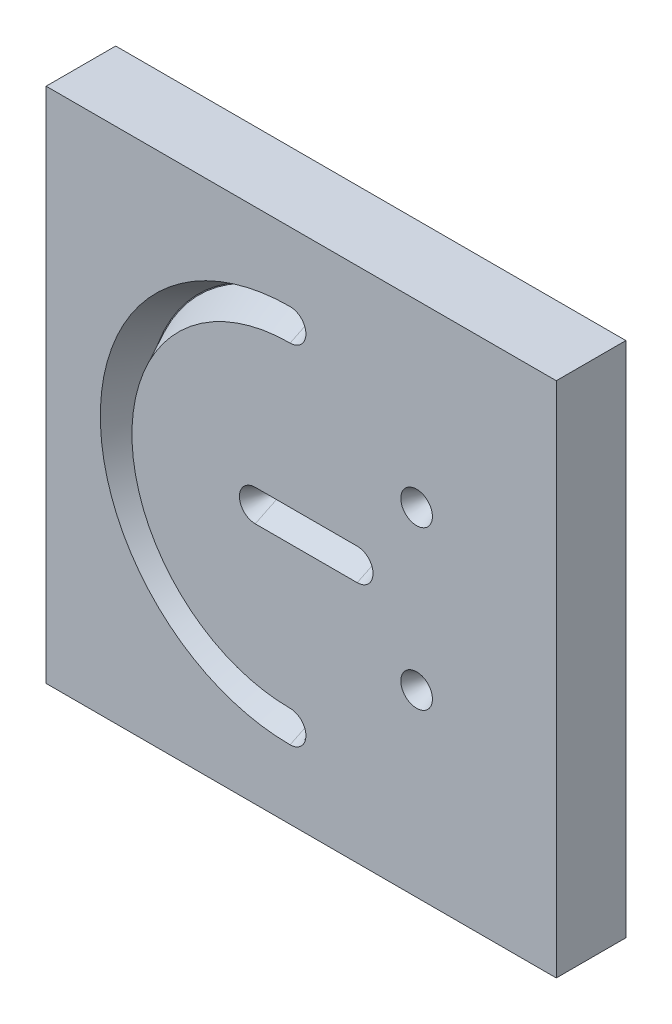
ISO-10303-21;
HEADER;
FILE_DESCRIPTION(('STEP AP214'),'2;1');
FILE_NAME('part.step','',(''),(''),'','','');
FILE_SCHEMA(('AUTOMOTIVE_DESIGN { 1 0 10303 214 1 1 1 1 }'));
ENDSEC;
DATA;
#1=APPLICATION_CONTEXT('core data for automotive mechanical design processes');
#2=APPLICATION_PROTOCOL_DEFINITION('international standard','automotive_design',2000,#1);
#3=PRODUCT_CONTEXT('',#1,'mechanical');
#4=PRODUCT('Part','Part','',(#3));
#5=PRODUCT_RELATED_PRODUCT_CATEGORY('part','',(#4));
#6=PRODUCT_DEFINITION_FORMATION('','',#4);
#7=PRODUCT_DEFINITION_CONTEXT('part definition',#1,'design');
#8=PRODUCT_DEFINITION('design','',#6,#7);
#9=PRODUCT_DEFINITION_SHAPE('','',#8);
#10=(LENGTH_UNIT() NAMED_UNIT(*) SI_UNIT(.MILLI.,.METRE.));
#11=(NAMED_UNIT(*) PLANE_ANGLE_UNIT() SI_UNIT($,.RADIAN.));
#12=(NAMED_UNIT(*) SI_UNIT($,.STERADIAN.) SOLID_ANGLE_UNIT());
#13=UNCERTAINTY_MEASURE_WITH_UNIT(LENGTH_MEASURE(1.E-05),#10,'distance_accuracy_value','');
#14=(GEOMETRIC_REPRESENTATION_CONTEXT(3) GLOBAL_UNCERTAINTY_ASSIGNED_CONTEXT((#13)) GLOBAL_UNIT_ASSIGNED_CONTEXT((#10,
#11,#12)) REPRESENTATION_CONTEXT('',''));
#15=CARTESIAN_POINT('',(0.,0.,0.));
#16=DIRECTION('',(0.,0.,1.));
#17=DIRECTION('',(1.,0.,0.));
#18=AXIS2_PLACEMENT_3D('',#15,#16,#17);
#19=CARTESIAN_POINT('',(0.,0.,11.));
#20=DIRECTION('',(1.,0.,0.));
#21=DIRECTION('',(0.,0.,-1.));
#22=AXIS2_PLACEMENT_3D('',#19,#20,#21);
#23=PLANE('',#22);
#24=DIRECTION('',(0.,-1.,0.));
#25=VECTOR('',#24,1.);
#26=CARTESIAN_POINT('',(0.,0.,0.));
#27=LINE('',#26,#25);
#28=CARTESIAN_POINT('',(0.,81.7717731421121,0.));
#29=VERTEX_POINT('',#28);
#30=CARTESIAN_POINT('',(0.,0.,0.));
#31=VERTEX_POINT('',#30);
#32=EDGE_CURVE('E203',#29,#31,#27,.T.);
#33=ORIENTED_EDGE('',*,*,#32,.T.);
#34=DIRECTION('',(0.,0.,-1.));
#35=VECTOR('',#34,1.);
#36=CARTESIAN_POINT('',(0.,0.,11.));
#37=LINE('',#36,#35);
#38=CARTESIAN_POINT('',(0.,0.,11.));
#39=VERTEX_POINT('',#38);
#40=EDGE_CURVE('E11',#39,#31,#37,.T.);
#41=ORIENTED_EDGE('',*,*,#40,.F.);
#42=DIRECTION('',(0.,-1.,0.));
#43=VECTOR('',#42,1.);
#44=CARTESIAN_POINT('',(0.,0.,11.));
#45=LINE('',#44,#43);
#46=CARTESIAN_POINT('',(0.,81.7717731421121,11.));
#47=VERTEX_POINT('',#46);
#48=EDGE_CURVE('E204',#47,#39,#45,.T.);
#49=ORIENTED_EDGE('',*,*,#48,.F.);
#50=DIRECTION('',(0.,0.,-1.));
#51=VECTOR('',#50,1.);
#52=CARTESIAN_POINT('',(0.,81.7717731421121,11.));
#53=LINE('',#52,#51);
#54=EDGE_CURVE('E214',#47,#29,#53,.T.);
#55=ORIENTED_EDGE('',*,*,#54,.T.);
#56=EDGE_LOOP('',(#33,#41,#49,#55));
#57=FACE_BOUND('',#56,.T.);
#58=ADVANCED_FACE('F33',(#57),#23,.F.);
#59=CARTESIAN_POINT('',(0.,0.,11.));
#60=DIRECTION('',(0.,1.,0.));
#61=DIRECTION('',(0.,0.,1.));
#62=AXIS2_PLACEMENT_3D('',#59,#60,#61);
#63=PLANE('',#62);
#64=DIRECTION('',(1.,0.,0.));
#65=VECTOR('',#64,1.);
#66=CARTESIAN_POINT('',(0.,0.,0.));
#67=LINE('',#66,#65);
#68=CARTESIAN_POINT('',(80.6458279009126,0.,0.));
#69=VERTEX_POINT('',#68);
#70=EDGE_CURVE('E217',#31,#69,#67,.T.);
#71=ORIENTED_EDGE('',*,*,#70,.T.);
#72=DIRECTION('',(0.,0.,-1.));
#73=VECTOR('',#72,1.);
#74=CARTESIAN_POINT('',(80.6458279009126,0.,11.));
#75=LINE('',#74,#73);
#76=CARTESIAN_POINT('',(80.6458279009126,0.,11.));
#77=VERTEX_POINT('',#76);
#78=EDGE_CURVE('E40',#77,#69,#75,.T.);
#79=ORIENTED_EDGE('',*,*,#78,.F.);
#80=DIRECTION('',(1.,0.,0.));
#81=VECTOR('',#80,1.);
#82=CARTESIAN_POINT('',(0.,0.,11.));
#83=LINE('',#82,#81);
#84=EDGE_CURVE('E207',#39,#77,#83,.T.);
#85=ORIENTED_EDGE('',*,*,#84,.F.);
#86=ORIENTED_EDGE('',*,*,#40,.T.);
#87=EDGE_LOOP('',(#71,#79,#85,#86));
#88=FACE_BOUND('',#87,.T.);
#89=ADVANCED_FACE('F246',(#88),#63,.F.);
#90=CARTESIAN_POINT('',(80.6458279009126,0.,11.));
#91=DIRECTION('',(-1.,0.,0.));
#92=DIRECTION('',(0.,0.,1.));
#93=AXIS2_PLACEMENT_3D('',#90,#91,#92);
#94=PLANE('',#93);
#95=DIRECTION('',(0.,1.,0.));
#96=VECTOR('',#95,1.);
#97=CARTESIAN_POINT('',(80.6458279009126,0.,0.));
#98=LINE('',#97,#96);
#99=CARTESIAN_POINT('',(80.6458279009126,81.7717731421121,0.));
#100=VERTEX_POINT('',#99);
#101=EDGE_CURVE('E219',#69,#100,#98,.T.);
#102=ORIENTED_EDGE('',*,*,#101,.T.);
#103=DIRECTION('',(0.,0.,-1.));
#104=VECTOR('',#103,1.);
#105=CARTESIAN_POINT('',(80.6458279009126,81.7717731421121,11.));
#106=LINE('',#105,#104);
#107=CARTESIAN_POINT('',(80.6458279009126,81.7717731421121,11.));
#108=VERTEX_POINT('',#107);
#109=EDGE_CURVE('E224',#108,#100,#106,.T.);
#110=ORIENTED_EDGE('',*,*,#109,.F.);
#111=DIRECTION('',(0.,1.,0.));
#112=VECTOR('',#111,1.);
#113=CARTESIAN_POINT('',(80.6458279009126,0.,11.));
#114=LINE('',#113,#112);
#115=EDGE_CURVE('E210',#77,#108,#114,.T.);
#116=ORIENTED_EDGE('',*,*,#115,.F.);
#117=ORIENTED_EDGE('',*,*,#78,.T.);
#118=EDGE_LOOP('',(#102,#110,#116,#117));
#119=FACE_BOUND('',#118,.T.);
#120=ADVANCED_FACE('F231',(#119),#94,.F.);
#121=CARTESIAN_POINT('',(0.,81.7717731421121,11.));
#122=DIRECTION('',(0.,-1.,0.));
#123=DIRECTION('',(0.,0.,-1.));
#124=AXIS2_PLACEMENT_3D('',#121,#122,#123);
#125=PLANE('',#124);
#126=DIRECTION('',(-1.,0.,0.));
#127=VECTOR('',#126,1.);
#128=CARTESIAN_POINT('',(0.,81.7717731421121,0.));
#129=LINE('',#128,#127);
#130=EDGE_CURVE('E208',#100,#29,#129,.T.);
#131=ORIENTED_EDGE('',*,*,#130,.T.);
#132=ORIENTED_EDGE('',*,*,#54,.F.);
#133=DIRECTION('',(-1.,0.,0.));
#134=VECTOR('',#133,1.);
#135=CARTESIAN_POINT('',(0.,81.7717731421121,11.));
#136=LINE('',#135,#134);
#137=EDGE_CURVE('E212',#108,#47,#136,.T.);
#138=ORIENTED_EDGE('',*,*,#137,.F.);
#139=ORIENTED_EDGE('',*,*,#109,.T.);
#140=EDGE_LOOP('',(#131,#132,#138,#139));
#141=FACE_BOUND('',#140,.T.);
#142=ADVANCED_FACE('F240',(#141),#125,.F.);
#143=CARTESIAN_POINT('',(0.,81.7717731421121,11.));
#144=DIRECTION('',(0.,0.,-1.));
#145=DIRECTION('',(-1.,0.,0.));
#146=AXIS2_PLACEMENT_3D('',#143,#144,#145);
#147=PLANE('',#146);
#148=DIRECTION('',(-1.,0.,0.));
#149=VECTOR('',#148,1.);
#150=CARTESIAN_POINT('',(49.1783221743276,43.3858865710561,11.));
#151=LINE('',#150,#149);
#152=CARTESIAN_POINT('',(49.1783221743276,43.3858865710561,11.));
#153=VERTEX_POINT('',#152);
#154=CARTESIAN_POINT('',(33.0551924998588,43.3858865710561,11.));
#155=VERTEX_POINT('',#154);
#156=EDGE_CURVE('E136',#153,#155,#151,.T.);
#157=ORIENTED_EDGE('',*,*,#156,.F.);
#158=CARTESIAN_POINT('',(49.1783221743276,40.8858865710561,11.));
#159=DIRECTION('',(0.,0.,1.));
#160=DIRECTION('',(1.,0.,0.));
#161=AXIS2_PLACEMENT_3D('',#158,#159,#160);
#162=CIRCLE('',#161,2.5);
#163=CARTESIAN_POINT('',(49.1783221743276,38.3858865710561,11.));
#164=VERTEX_POINT('',#163);
#165=EDGE_CURVE('E47',#164,#153,#162,.T.);
#166=ORIENTED_EDGE('',*,*,#165,.F.);
#167=DIRECTION('',(1.,0.,0.));
#168=VECTOR('',#167,1.);
#169=CARTESIAN_POINT('',(49.1783221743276,38.3858865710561,11.));
#170=LINE('',#169,#168);
#171=CARTESIAN_POINT('',(33.0551924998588,38.3858865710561,11.));
#172=VERTEX_POINT('',#171);
#173=EDGE_CURVE('E143',#172,#164,#170,.T.);
#174=ORIENTED_EDGE('',*,*,#173,.F.);
#175=CARTESIAN_POINT('',(33.0551924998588,40.8858865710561,11.));
#176=DIRECTION('',(0.,0.,1.));
#177=DIRECTION('',(1.,0.,0.));
#178=AXIS2_PLACEMENT_3D('',#175,#176,#177);
#179=CIRCLE('',#178,2.5);
#180=EDGE_CURVE('E125',#155,#172,#179,.T.);
#181=ORIENTED_EDGE('',*,*,#180,.F.);
#182=EDGE_LOOP('',(#157,#166,#174,#181));
#183=FACE_BOUND('',#182,.T.);
#184=CARTESIAN_POINT('',(58.5670905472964,53.3858865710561,11.));
#185=DIRECTION('',(0.,0.,1.));
#186=DIRECTION('',(1.,0.,0.));
#187=AXIS2_PLACEMENT_3D('',#184,#185,#186);
#188=CIRCLE('',#187,2.5);
#189=CARTESIAN_POINT('',(61.0670905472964,53.3858865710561,11.));
#190=VERTEX_POINT('',#189);
#191=EDGE_CURVE('E151',#190,#190,#188,.T.);
#192=ORIENTED_EDGE('',*,*,#191,.F.);
#193=EDGE_LOOP('',(#192));
#194=FACE_BOUND('',#193,.T.);
#195=CARTESIAN_POINT('',(38.5670905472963,40.8858865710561,11.));
#196=DIRECTION('',(0.,0.,1.));
#197=DIRECTION('',(1.,0.,0.));
#198=AXIS2_PLACEMENT_3D('',#195,#196,#197);
#199=CIRCLE('',#198,30.);
#200=CARTESIAN_POINT('',(38.5670905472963,70.8858865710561,11.));
#201=VERTEX_POINT('',#200);
#202=CARTESIAN_POINT('',(38.5670905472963,10.8858865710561,11.));
#203=VERTEX_POINT('',#202);
#204=EDGE_CURVE('E168',#201,#203,#199,.T.);
#205=ORIENTED_EDGE('',*,*,#204,.F.);
#206=CARTESIAN_POINT('',(38.5670905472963,68.3858865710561,11.));
#207=DIRECTION('',(0.,0.,1.));
#208=DIRECTION('',(1.,0.,0.));
#209=AXIS2_PLACEMENT_3D('',#206,#207,#208);
#210=CIRCLE('',#209,2.5);
#211=CARTESIAN_POINT('',(38.5670905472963,65.8858865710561,11.));
#212=VERTEX_POINT('',#211);
#213=EDGE_CURVE('E55',#212,#201,#210,.T.);
#214=ORIENTED_EDGE('',*,*,#213,.F.);
#215=CARTESIAN_POINT('',(38.5670905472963,40.8858865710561,11.));
#216=DIRECTION('',(0.,0.,-1.));
#217=DIRECTION('',(1.,0.,0.));
#218=AXIS2_PLACEMENT_3D('',#215,#216,#217);
#219=CIRCLE('',#218,25.);
#220=CARTESIAN_POINT('',(38.5670905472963,15.8858865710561,11.));
#221=VERTEX_POINT('',#220);
#222=EDGE_CURVE('E174',#221,#212,#219,.T.);
#223=ORIENTED_EDGE('',*,*,#222,.F.);
#224=CARTESIAN_POINT('',(38.5670905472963,13.3858865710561,11.));
#225=DIRECTION('',(0.,0.,1.));
#226=DIRECTION('',(1.,0.,0.));
#227=AXIS2_PLACEMENT_3D('',#224,#225,#226);
#228=CIRCLE('',#227,2.5);
#229=EDGE_CURVE('E171',#203,#221,#228,.T.);
#230=ORIENTED_EDGE('',*,*,#229,.F.);
#231=EDGE_LOOP('',(#205,#214,#223,#230));
#232=FACE_BOUND('',#231,.T.);
#233=CARTESIAN_POINT('',(58.5670905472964,28.3858865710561,11.));
#234=DIRECTION('',(0.,0.,1.));
#235=DIRECTION('',(1.,0.,0.));
#236=AXIS2_PLACEMENT_3D('',#233,#234,#235);
#237=CIRCLE('',#236,2.5);
#238=CARTESIAN_POINT('',(61.0670905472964,28.3858865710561,11.));
#239=VERTEX_POINT('',#238);
#240=EDGE_CURVE('E180',#239,#239,#237,.T.);
#241=ORIENTED_EDGE('',*,*,#240,.F.);
#242=EDGE_LOOP('',(#241));
#243=FACE_BOUND('',#242,.T.);
#244=ORIENTED_EDGE('',*,*,#48,.T.);
#245=ORIENTED_EDGE('',*,*,#84,.T.);
#246=ORIENTED_EDGE('',*,*,#115,.T.);
#247=ORIENTED_EDGE('',*,*,#137,.T.);
#248=EDGE_LOOP('',(#244,#245,#246,#247));
#249=FACE_BOUND('',#248,.T.);
#250=ADVANCED_FACE('F140',(#183,#194,#232,#243,#249),#147,.F.);
#251=CARTESIAN_POINT('',(0.,81.7717731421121,0.));
#252=DIRECTION('',(0.,0.,-1.));
#253=DIRECTION('',(-1.,0.,0.));
#254=AXIS2_PLACEMENT_3D('',#251,#252,#253);
#255=PLANE('',#254);
#256=ORIENTED_EDGE('',*,*,#32,.F.);
#257=ORIENTED_EDGE('',*,*,#130,.F.);
#258=ORIENTED_EDGE('',*,*,#101,.F.);
#259=ORIENTED_EDGE('',*,*,#70,.F.);
#260=EDGE_LOOP('',(#256,#257,#258,#259));
#261=FACE_BOUND('',#260,.T.);
#262=ADVANCED_FACE('F237',(#261),#255,.T.);
#263=CARTESIAN_POINT('',(58.5670905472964,28.3858865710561,11.));
#264=DIRECTION('',(0.,0.,1.));
#265=DIRECTION('',(1.,0.,0.));
#266=AXIS2_PLACEMENT_3D('',#263,#264,#265);
#267=CONICAL_SURFACE('',#266,2.5,0.453785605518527);
#268=CARTESIAN_POINT('',(58.5670905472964,28.3858865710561,6.));
#269=DIRECTION('',(0.,0.,1.));
#270=DIRECTION('',(1.,0.,0.));
#271=AXIS2_PLACEMENT_3D('',#268,#269,#270);
#272=CIRCLE('',#271,0.0613370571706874);
#273=CARTESIAN_POINT('',(58.628427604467,28.3858865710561,6.));
#274=VERTEX_POINT('',#273);
#275=EDGE_CURVE('E200',#274,#274,#272,.T.);
#276=CARTESIAN_POINT('',(58.628427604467,28.3858865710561,6.));
#277=CARTESIAN_POINT('',(58.6538303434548,28.3858865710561,6.05208333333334));
#278=CARTESIAN_POINT('',(58.6792330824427,28.3858865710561,6.10416666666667));
#279=CARTESIAN_POINT('',(58.7300385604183,28.3858865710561,6.20833333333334));
#280=CARTESIAN_POINT('',(58.7554412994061,28.3858865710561,6.26041666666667));
#281=CARTESIAN_POINT('',(58.8062467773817,28.3858865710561,6.36458333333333));
#282=CARTESIAN_POINT('',(58.8316495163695,28.3858865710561,6.41666666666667));
#283=CARTESIAN_POINT('',(58.8824549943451,28.3858865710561,6.52083333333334));
#284=CARTESIAN_POINT('',(58.9078577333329,28.3858865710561,6.57291666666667));
#285=CARTESIAN_POINT('',(58.9586632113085,28.3858865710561,6.67708333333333));
#286=CARTESIAN_POINT('',(58.9840659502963,28.3858865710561,6.72916666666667));
#287=CARTESIAN_POINT('',(59.0348714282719,28.3858865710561,6.83333333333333));
#288=CARTESIAN_POINT('',(59.0602741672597,28.3858865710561,6.88541666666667));
#289=CARTESIAN_POINT('',(59.1110796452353,28.3858865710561,6.98958333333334));
#290=CARTESIAN_POINT('',(59.1364823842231,28.3858865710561,7.04166666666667));
#291=CARTESIAN_POINT('',(59.1872878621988,28.3858865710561,7.14583333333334));
#292=CARTESIAN_POINT('',(59.2126906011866,28.3858865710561,7.19791666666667));
#293=CARTESIAN_POINT('',(59.2634960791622,28.3858865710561,7.30208333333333));
#294=CARTESIAN_POINT('',(59.28889881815,28.3858865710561,7.35416666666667));
#295=CARTESIAN_POINT('',(59.3397042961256,28.3858865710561,7.45833333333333));
#296=CARTESIAN_POINT('',(59.3651070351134,28.3858865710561,7.51041666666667));
#297=CARTESIAN_POINT('',(59.415912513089,28.3858865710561,7.61458333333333));
#298=CARTESIAN_POINT('',(59.4413152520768,28.3858865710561,7.66666666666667));
#299=CARTESIAN_POINT('',(59.4921207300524,28.3858865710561,7.77083333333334));
#300=CARTESIAN_POINT('',(59.5175234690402,28.3858865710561,7.82291666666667));
#301=CARTESIAN_POINT('',(59.5683289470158,28.3858865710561,7.92708333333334));
#302=CARTESIAN_POINT('',(59.5937316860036,28.3858865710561,7.97916666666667));
#303=CARTESIAN_POINT('',(59.6445371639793,28.3858865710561,8.08333333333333));
#304=CARTESIAN_POINT('',(59.6699399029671,28.3858865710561,8.13541666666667));
#305=CARTESIAN_POINT('',(59.7207453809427,28.3858865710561,8.23958333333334));
#306=CARTESIAN_POINT('',(59.7461481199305,28.3858865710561,8.29166666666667));
#307=CARTESIAN_POINT('',(59.7969535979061,28.3858865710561,8.39583333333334));
#308=CARTESIAN_POINT('',(59.8223563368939,28.3858865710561,8.44791666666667));
#309=CARTESIAN_POINT('',(59.8731618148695,28.3858865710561,8.55208333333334));
#310=CARTESIAN_POINT('',(59.8985645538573,28.3858865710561,8.60416666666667));
#311=CARTESIAN_POINT('',(59.9493700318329,28.3858865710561,8.70833333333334));
#312=CARTESIAN_POINT('',(59.9747727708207,28.3858865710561,8.76041666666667));
#313=CARTESIAN_POINT('',(60.0255782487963,28.3858865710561,8.86458333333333));
#314=CARTESIAN_POINT('',(60.0509809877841,28.3858865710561,8.91666666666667));
#315=CARTESIAN_POINT('',(60.1017864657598,28.3858865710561,9.02083333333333));
#316=CARTESIAN_POINT('',(60.1271892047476,28.3858865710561,9.07291666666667));
#317=CARTESIAN_POINT('',(60.1779946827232,28.3858865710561,9.17708333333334));
#318=CARTESIAN_POINT('',(60.203397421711,28.3858865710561,9.22916666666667));
#319=CARTESIAN_POINT('',(60.2542028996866,28.3858865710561,9.33333333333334));
#320=CARTESIAN_POINT('',(60.2796056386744,28.3858865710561,9.38541666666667));
#321=CARTESIAN_POINT('',(60.33041111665,28.3858865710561,9.48958333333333));
#322=CARTESIAN_POINT('',(60.3558138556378,28.3858865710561,9.54166666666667));
#323=CARTESIAN_POINT('',(60.4066193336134,28.3858865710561,9.64583333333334));
#324=CARTESIAN_POINT('',(60.4320220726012,28.3858865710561,9.69791666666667));
#325=CARTESIAN_POINT('',(60.4828275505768,28.3858865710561,9.80208333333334));
#326=CARTESIAN_POINT('',(60.5082302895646,28.3858865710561,9.85416666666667));
#327=CARTESIAN_POINT('',(60.5590357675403,28.3858865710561,9.95833333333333));
#328=CARTESIAN_POINT('',(60.5844385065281,28.3858865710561,10.0104166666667));
#329=CARTESIAN_POINT('',(60.6352439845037,28.3858865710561,10.1145833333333));
#330=CARTESIAN_POINT('',(60.6606467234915,28.3858865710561,10.1666666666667));
#331=CARTESIAN_POINT('',(60.7114522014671,28.3858865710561,10.2708333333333));
#332=CARTESIAN_POINT('',(60.7368549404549,28.3858865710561,10.3229166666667));
#333=CARTESIAN_POINT('',(60.7876604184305,28.3858865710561,10.4270833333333));
#334=CARTESIAN_POINT('',(60.8130631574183,28.3858865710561,10.4791666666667));
#335=CARTESIAN_POINT('',(60.8638686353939,28.3858865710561,10.5833333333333));
#336=CARTESIAN_POINT('',(60.8892713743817,28.3858865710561,10.6354166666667));
#337=CARTESIAN_POINT('',(60.9400768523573,28.3858865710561,10.7395833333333));
#338=CARTESIAN_POINT('',(60.9654795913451,28.3858865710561,10.7916666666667));
#339=CARTESIAN_POINT('',(61.0162850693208,28.3858865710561,10.8958333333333));
#340=CARTESIAN_POINT('',(61.0416878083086,28.3858865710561,10.9479166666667));
#341=CARTESIAN_POINT('',(61.0670905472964,28.3858865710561,11.));
#342=B_SPLINE_CURVE_WITH_KNOTS('',3,(#276,#277,#278,#279,#280,#281,#282,#283,#284,#285,#286,
#287,#288,#289,#290,#291,#292,#293,#294,#295,#296,#297,#298,#299,#300,#301,#302,#303,#304,#305,
#306,#307,#308,#309,#310,#311,#312,#313,#314,#315,#316,#317,#318,#319,#320,#321,#322,#323,#324,
#325,#326,#327,#328,#329,#330,#331,#332,#333,#334,#335,#336,#337,#338,#339,#340,#341),
.UNSPECIFIED.,.F.,.F.,(4,2,2,2,2,2,2,2,2,2,2,2,2,2,2,2,2,2,2,2,2,2,2,2,2,2,2,2,2,2,2,2,4),(0.,
0.173844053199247,0.347688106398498,0.521532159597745,0.695376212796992,0.869220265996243,
1.04306431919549,1.21690837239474,1.39075242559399,1.56459647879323,1.73844053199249,
1.91228458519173,2.08612863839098,2.25997269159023,2.43381674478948,2.60766079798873,
2.78150485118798,2.95534890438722,3.12919295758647,3.30303701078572,3.47688106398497,
3.65072511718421,3.82456917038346,3.99841322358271,4.17225727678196,4.34610132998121,
4.51994538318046,4.69378943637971,4.86763348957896,5.0414775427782,5.21532159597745,
5.3891656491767,5.56300970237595),.UNSPECIFIED.);
#343=EDGE_CURVE('BSEAM258',#274,#239,#342,.T.);
#344=ORIENTED_EDGE('',*,*,#275,.F.);
#345=ORIENTED_EDGE('',*,*,#240,.T.);
#346=ORIENTED_EDGE('',*,*,#343,.T.);
#347=ORIENTED_EDGE('',*,*,#343,.F.);
#348=EDGE_LOOP('',(#344,#346,#345,#347));
#349=FACE_BOUND('',#348,.T.);
#350=ADVANCED_FACE('F258',(#349),#267,.F.);
#351=CARTESIAN_POINT('',(58.5670905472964,28.3858865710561,6.));
#352=DIRECTION('',(0.,0.,1.));
#353=DIRECTION('',(1.,0.,0.));
#354=AXIS2_PLACEMENT_3D('',#351,#352,#353);
#355=PLANE('',#354);
#356=ORIENTED_EDGE('',*,*,#275,.T.);
#357=EDGE_LOOP('',(#356));
#358=FACE_BOUND('',#357,.T.);
#359=ADVANCED_FACE('F263',(#358),#355,.T.);
#360=CARTESIAN_POINT('',(38.5670905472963,68.3858865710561,11.));
#361=DIRECTION('',(0.,0.,1.));
#362=DIRECTION('',(1.,0.,0.));
#363=AXIS2_PLACEMENT_3D('',#360,#361,#362);
#364=CONICAL_SURFACE('',#363,2.5,0.453785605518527);
#365=ORIENTED_EDGE('',*,*,#213,.T.);
#366=DIRECTION('',(0.,0.438371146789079,0.898794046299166));
#367=VECTOR('',#366,1.);
#368=CARTESIAN_POINT('',(38.5670905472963,70.8858865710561,11.));
#369=LINE('',#368,#367);
#370=CARTESIAN_POINT('',(38.5670905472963,68.4472236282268,6.));
#371=VERTEX_POINT('',#370);
#372=EDGE_CURVE('E182',#371,#201,#369,.T.);
#373=ORIENTED_EDGE('',*,*,#372,.F.);
#374=CARTESIAN_POINT('',(38.5670905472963,68.3858865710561,6.));
#375=DIRECTION('',(0.,0.,1.));
#376=DIRECTION('',(1.,0.,0.));
#377=AXIS2_PLACEMENT_3D('',#374,#375,#376);
#378=CIRCLE('',#377,0.061337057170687);
#379=CARTESIAN_POINT('',(38.5670905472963,68.3245495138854,6.));
#380=VERTEX_POINT('',#379);
#381=EDGE_CURVE('E177',#380,#371,#378,.T.);
#382=ORIENTED_EDGE('',*,*,#381,.F.);
#383=DIRECTION('',(0.,-0.438371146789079,0.898794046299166));
#384=VECTOR('',#383,1.);
#385=CARTESIAN_POINT('',(38.5670905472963,65.8858865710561,11.));
#386=LINE('',#385,#384);
#387=EDGE_CURVE('E178',#380,#212,#386,.T.);
#388=ORIENTED_EDGE('',*,*,#387,.T.);
#389=EDGE_LOOP('',(#365,#373,#382,#388));
#390=FACE_BOUND('',#389,.T.);
#391=ADVANCED_FACE('F267',(#390),#364,.F.);
#392=CARTESIAN_POINT('',(38.5670905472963,40.8858865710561,11.));
#393=DIRECTION('',(0.,0.,-1.));
#394=DIRECTION('',(1.,0.,0.));
#395=AXIS2_PLACEMENT_3D('',#392,#393,#394);
#396=CONICAL_SURFACE('',#395,25.,0.453785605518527);
#397=ORIENTED_EDGE('',*,*,#222,.T.);
#398=ORIENTED_EDGE('',*,*,#387,.F.);
#399=CARTESIAN_POINT('',(38.5670905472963,40.8858865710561,6.));
#400=DIRECTION('',(0.,0.,1.));
#401=DIRECTION('',(1.,0.,0.));
#402=AXIS2_PLACEMENT_3D('',#399,#400,#401);
#403=CIRCLE('',#402,27.4386629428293);
#404=CARTESIAN_POINT('',(38.5670905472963,13.4472236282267,6.));
#405=VERTEX_POINT('',#404);
#406=EDGE_CURVE('E185',#405,#380,#403,.F.);
#407=ORIENTED_EDGE('',*,*,#406,.F.);
#408=DIRECTION('',(0.,0.438371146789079,0.898794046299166));
#409=VECTOR('',#408,1.);
#410=CARTESIAN_POINT('',(38.5670905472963,15.8858865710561,11.));
#411=LINE('',#410,#409);
#412=EDGE_CURVE('E181',#405,#221,#411,.T.);
#413=ORIENTED_EDGE('',*,*,#412,.T.);
#414=EDGE_LOOP('',(#397,#398,#407,#413));
#415=FACE_BOUND('',#414,.T.);
#416=ADVANCED_FACE('F269',(#415),#396,.T.);
#417=CARTESIAN_POINT('',(38.5670905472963,13.3858865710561,11.));
#418=DIRECTION('',(0.,0.,1.));
#419=DIRECTION('',(1.,0.,0.));
#420=AXIS2_PLACEMENT_3D('',#417,#418,#419);
#421=CONICAL_SURFACE('',#420,2.5,0.453785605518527);
#422=ORIENTED_EDGE('',*,*,#229,.T.);
#423=ORIENTED_EDGE('',*,*,#412,.F.);
#424=CARTESIAN_POINT('',(38.5670905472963,13.3858865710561,6.));
#425=DIRECTION('',(0.,0.,1.));
#426=DIRECTION('',(1.,0.,0.));
#427=AXIS2_PLACEMENT_3D('',#424,#425,#426);
#428=CIRCLE('',#427,0.0613370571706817);
#429=CARTESIAN_POINT('',(38.5670905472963,13.3245495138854,6.));
#430=VERTEX_POINT('',#429);
#431=EDGE_CURVE('E193',#430,#405,#428,.T.);
#432=ORIENTED_EDGE('',*,*,#431,.F.);
#433=DIRECTION('',(0.,-0.438371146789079,0.898794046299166));
#434=VECTOR('',#433,1.);
#435=CARTESIAN_POINT('',(38.5670905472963,10.8858865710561,11.));
#436=LINE('',#435,#434);
#437=EDGE_CURVE('E184',#430,#203,#436,.T.);
#438=ORIENTED_EDGE('',*,*,#437,.T.);
#439=EDGE_LOOP('',(#422,#423,#432,#438));
#440=FACE_BOUND('',#439,.T.);
#441=ADVANCED_FACE('F272',(#440),#421,.F.);
#442=CARTESIAN_POINT('',(38.5670905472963,40.8858865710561,11.));
#443=DIRECTION('',(0.,0.,1.));
#444=DIRECTION('',(1.,0.,0.));
#445=AXIS2_PLACEMENT_3D('',#442,#443,#444);
#446=CONICAL_SURFACE('',#445,30.,0.453785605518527);
#447=ORIENTED_EDGE('',*,*,#204,.T.);
#448=ORIENTED_EDGE('',*,*,#437,.F.);
#449=CARTESIAN_POINT('',(38.5670905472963,40.8858865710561,6.));
#450=DIRECTION('',(0.,0.,1.));
#451=DIRECTION('',(1.,0.,0.));
#452=AXIS2_PLACEMENT_3D('',#449,#450,#451);
#453=CIRCLE('',#452,27.5613370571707);
#454=EDGE_CURVE('E190',#371,#430,#453,.T.);
#455=ORIENTED_EDGE('',*,*,#454,.F.);
#456=ORIENTED_EDGE('',*,*,#372,.T.);
#457=EDGE_LOOP('',(#447,#448,#455,#456));
#458=FACE_BOUND('',#457,.T.);
#459=ADVANCED_FACE('F276',(#458),#446,.F.);
#460=CARTESIAN_POINT('',(38.5670905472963,54.6358865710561,6.));
#461=DIRECTION('',(0.,0.,1.));
#462=DIRECTION('',(1.,0.,0.));
#463=AXIS2_PLACEMENT_3D('',#460,#461,#462);
#464=PLANE('',#463);
#465=ORIENTED_EDGE('',*,*,#381,.T.);
#466=ORIENTED_EDGE('',*,*,#454,.T.);
#467=ORIENTED_EDGE('',*,*,#431,.T.);
#468=ORIENTED_EDGE('',*,*,#406,.T.);
#469=EDGE_LOOP('',(#465,#466,#467,#468));
#470=FACE_BOUND('',#469,.T.);
#471=ADVANCED_FACE('F280',(#470),#464,.T.);
#472=CARTESIAN_POINT('',(58.5670905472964,53.3858865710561,11.));
#473=DIRECTION('',(0.,0.,1.));
#474=DIRECTION('',(1.,0.,0.));
#475=AXIS2_PLACEMENT_3D('',#472,#473,#474);
#476=CONICAL_SURFACE('',#475,2.5,0.453785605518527);
#477=CARTESIAN_POINT('',(58.5670905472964,53.3858865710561,6.));
#478=DIRECTION('',(0.,0.,1.));
#479=DIRECTION('',(1.,0.,0.));
#480=AXIS2_PLACEMENT_3D('',#477,#478,#479);
#481=CIRCLE('',#480,0.0613370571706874);
#482=CARTESIAN_POINT('',(58.628427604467,53.3858865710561,6.));
#483=VERTEX_POINT('',#482);
#484=EDGE_CURVE('E164',#483,#483,#481,.T.);
#485=CARTESIAN_POINT('',(58.628427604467,53.3858865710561,6.));
#486=CARTESIAN_POINT('',(58.6538303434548,53.3858865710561,6.05208333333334));
#487=CARTESIAN_POINT('',(58.6792330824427,53.3858865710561,6.10416666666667));
#488=CARTESIAN_POINT('',(58.7300385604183,53.3858865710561,6.20833333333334));
#489=CARTESIAN_POINT('',(58.7554412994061,53.3858865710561,6.26041666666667));
#490=CARTESIAN_POINT('',(58.8062467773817,53.3858865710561,6.36458333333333));
#491=CARTESIAN_POINT('',(58.8316495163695,53.3858865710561,6.41666666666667));
#492=CARTESIAN_POINT('',(58.8824549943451,53.3858865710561,6.52083333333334));
#493=CARTESIAN_POINT('',(58.9078577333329,53.3858865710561,6.57291666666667));
#494=CARTESIAN_POINT('',(58.9586632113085,53.3858865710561,6.67708333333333));
#495=CARTESIAN_POINT('',(58.9840659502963,53.3858865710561,6.72916666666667));
#496=CARTESIAN_POINT('',(59.0348714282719,53.3858865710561,6.83333333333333));
#497=CARTESIAN_POINT('',(59.0602741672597,53.3858865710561,6.88541666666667));
#498=CARTESIAN_POINT('',(59.1110796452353,53.3858865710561,6.98958333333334));
#499=CARTESIAN_POINT('',(59.1364823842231,53.3858865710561,7.04166666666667));
#500=CARTESIAN_POINT('',(59.1872878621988,53.3858865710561,7.14583333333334));
#501=CARTESIAN_POINT('',(59.2126906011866,53.3858865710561,7.19791666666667));
#502=CARTESIAN_POINT('',(59.2634960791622,53.3858865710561,7.30208333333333));
#503=CARTESIAN_POINT('',(59.28889881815,53.3858865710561,7.35416666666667));
#504=CARTESIAN_POINT('',(59.3397042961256,53.3858865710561,7.45833333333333));
#505=CARTESIAN_POINT('',(59.3651070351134,53.3858865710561,7.51041666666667));
#506=CARTESIAN_POINT('',(59.415912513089,53.3858865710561,7.61458333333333));
#507=CARTESIAN_POINT('',(59.4413152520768,53.3858865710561,7.66666666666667));
#508=CARTESIAN_POINT('',(59.4921207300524,53.3858865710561,7.77083333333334));
#509=CARTESIAN_POINT('',(59.5175234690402,53.3858865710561,7.82291666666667));
#510=CARTESIAN_POINT('',(59.5683289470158,53.3858865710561,7.92708333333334));
#511=CARTESIAN_POINT('',(59.5937316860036,53.3858865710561,7.97916666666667));
#512=CARTESIAN_POINT('',(59.6445371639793,53.3858865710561,8.08333333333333));
#513=CARTESIAN_POINT('',(59.6699399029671,53.3858865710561,8.13541666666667));
#514=CARTESIAN_POINT('',(59.7207453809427,53.3858865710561,8.23958333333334));
#515=CARTESIAN_POINT('',(59.7461481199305,53.3858865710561,8.29166666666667));
#516=CARTESIAN_POINT('',(59.7969535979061,53.3858865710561,8.39583333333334));
#517=CARTESIAN_POINT('',(59.8223563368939,53.3858865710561,8.44791666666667));
#518=CARTESIAN_POINT('',(59.8731618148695,53.3858865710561,8.55208333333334));
#519=CARTESIAN_POINT('',(59.8985645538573,53.3858865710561,8.60416666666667));
#520=CARTESIAN_POINT('',(59.9493700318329,53.3858865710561,8.70833333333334));
#521=CARTESIAN_POINT('',(59.9747727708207,53.3858865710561,8.76041666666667));
#522=CARTESIAN_POINT('',(60.0255782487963,53.3858865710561,8.86458333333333));
#523=CARTESIAN_POINT('',(60.0509809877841,53.3858865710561,8.91666666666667));
#524=CARTESIAN_POINT('',(60.1017864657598,53.3858865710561,9.02083333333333));
#525=CARTESIAN_POINT('',(60.1271892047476,53.3858865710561,9.07291666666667));
#526=CARTESIAN_POINT('',(60.1779946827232,53.3858865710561,9.17708333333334));
#527=CARTESIAN_POINT('',(60.203397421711,53.3858865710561,9.22916666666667));
#528=CARTESIAN_POINT('',(60.2542028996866,53.3858865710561,9.33333333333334));
#529=CARTESIAN_POINT('',(60.2796056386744,53.3858865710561,9.38541666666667));
#530=CARTESIAN_POINT('',(60.33041111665,53.3858865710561,9.48958333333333));
#531=CARTESIAN_POINT('',(60.3558138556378,53.3858865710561,9.54166666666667));
#532=CARTESIAN_POINT('',(60.4066193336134,53.3858865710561,9.64583333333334));
#533=CARTESIAN_POINT('',(60.4320220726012,53.3858865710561,9.69791666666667));
#534=CARTESIAN_POINT('',(60.4828275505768,53.3858865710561,9.80208333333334));
#535=CARTESIAN_POINT('',(60.5082302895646,53.3858865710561,9.85416666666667));
#536=CARTESIAN_POINT('',(60.5590357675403,53.3858865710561,9.95833333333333));
#537=CARTESIAN_POINT('',(60.5844385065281,53.3858865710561,10.0104166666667));
#538=CARTESIAN_POINT('',(60.6352439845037,53.3858865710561,10.1145833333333));
#539=CARTESIAN_POINT('',(60.6606467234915,53.3858865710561,10.1666666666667));
#540=CARTESIAN_POINT('',(60.7114522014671,53.3858865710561,10.2708333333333));
#541=CARTESIAN_POINT('',(60.7368549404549,53.3858865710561,10.3229166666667));
#542=CARTESIAN_POINT('',(60.7876604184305,53.3858865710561,10.4270833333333));
#543=CARTESIAN_POINT('',(60.8130631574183,53.3858865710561,10.4791666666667));
#544=CARTESIAN_POINT('',(60.8638686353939,53.3858865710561,10.5833333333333));
#545=CARTESIAN_POINT('',(60.8892713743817,53.3858865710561,10.6354166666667));
#546=CARTESIAN_POINT('',(60.9400768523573,53.3858865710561,10.7395833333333));
#547=CARTESIAN_POINT('',(60.9654795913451,53.3858865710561,10.7916666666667));
#548=CARTESIAN_POINT('',(61.0162850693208,53.3858865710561,10.8958333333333));
#549=CARTESIAN_POINT('',(61.0416878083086,53.3858865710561,10.9479166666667));
#550=CARTESIAN_POINT('',(61.0670905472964,53.3858865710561,11.));
#551=B_SPLINE_CURVE_WITH_KNOTS('',3,(#485,#486,#487,#488,#489,#490,#491,#492,#493,#494,#495,
#496,#497,#498,#499,#500,#501,#502,#503,#504,#505,#506,#507,#508,#509,#510,#511,#512,#513,#514,
#515,#516,#517,#518,#519,#520,#521,#522,#523,#524,#525,#526,#527,#528,#529,#530,#531,#532,#533,
#534,#535,#536,#537,#538,#539,#540,#541,#542,#543,#544,#545,#546,#547,#548,#549,#550),
.UNSPECIFIED.,.F.,.F.,(4,2,2,2,2,2,2,2,2,2,2,2,2,2,2,2,2,2,2,2,2,2,2,2,2,2,2,2,2,2,2,2,4),(0.,
0.173844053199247,0.347688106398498,0.521532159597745,0.695376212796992,0.869220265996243,
1.04306431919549,1.21690837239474,1.39075242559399,1.56459647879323,1.73844053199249,
1.91228458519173,2.08612863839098,2.25997269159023,2.43381674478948,2.60766079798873,
2.78150485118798,2.95534890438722,3.12919295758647,3.30303701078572,3.47688106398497,
3.65072511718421,3.82456917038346,3.99841322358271,4.17225727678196,4.34610132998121,
4.51994538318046,4.69378943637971,4.86763348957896,5.0414775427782,5.21532159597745,
5.3891656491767,5.56300970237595),.UNSPECIFIED.);
#552=EDGE_CURVE('BSEAM286',#483,#190,#551,.T.);
#553=ORIENTED_EDGE('',*,*,#484,.F.);
#554=ORIENTED_EDGE('',*,*,#191,.T.);
#555=ORIENTED_EDGE('',*,*,#552,.T.);
#556=ORIENTED_EDGE('',*,*,#552,.F.);
#557=EDGE_LOOP('',(#553,#555,#554,#556));
#558=FACE_BOUND('',#557,.T.);
#559=ADVANCED_FACE('F286',(#558),#476,.F.);
#560=CARTESIAN_POINT('',(58.5670905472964,53.3858865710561,6.));
#561=DIRECTION('',(0.,0.,1.));
#562=DIRECTION('',(1.,0.,0.));
#563=AXIS2_PLACEMENT_3D('',#560,#561,#562);
#564=PLANE('',#563);
#565=ORIENTED_EDGE('',*,*,#484,.T.);
#566=EDGE_LOOP('',(#565));
#567=FACE_BOUND('',#566,.T.);
#568=ADVANCED_FACE('F290',(#567),#564,.T.);
#569=CARTESIAN_POINT('',(49.1783221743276,40.8858865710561,11.));
#570=DIRECTION('',(0.,0.,1.));
#571=DIRECTION('',(1.,0.,0.));
#572=AXIS2_PLACEMENT_3D('',#569,#570,#571);
#573=CONICAL_SURFACE('',#572,2.5,0.453785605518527);
#574=ORIENTED_EDGE('',*,*,#165,.T.);
#575=DIRECTION('',(0.,0.438371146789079,0.898794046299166));
#576=VECTOR('',#575,1.);
#577=CARTESIAN_POINT('',(49.1783221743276,43.3858865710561,11.));
#578=LINE('',#577,#576);
#579=CARTESIAN_POINT('',(49.1783221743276,40.9472236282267,6.));
#580=VERTEX_POINT('',#579);
#581=EDGE_CURVE('E133',#580,#153,#578,.T.);
#582=ORIENTED_EDGE('',*,*,#581,.F.);
#583=CARTESIAN_POINT('',(49.1783221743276,40.8858865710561,6.));
#584=DIRECTION('',(0.,0.,1.));
#585=DIRECTION('',(1.,0.,0.));
#586=AXIS2_PLACEMENT_3D('',#583,#584,#585);
#587=CIRCLE('',#586,0.061337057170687);
#588=CARTESIAN_POINT('',(49.1783221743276,40.8245495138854,6.));
#589=VERTEX_POINT('',#588);
#590=EDGE_CURVE('E145',#589,#580,#587,.T.);
#591=ORIENTED_EDGE('',*,*,#590,.F.);
#592=DIRECTION('',(0.,-0.438371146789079,0.898794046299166));
#593=VECTOR('',#592,1.);
#594=CARTESIAN_POINT('',(49.1783221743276,38.3858865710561,11.));
#595=LINE('',#594,#593);
#596=EDGE_CURVE('E149',#589,#164,#595,.T.);
#597=ORIENTED_EDGE('',*,*,#596,.T.);
#598=EDGE_LOOP('',(#574,#582,#591,#597));
#599=FACE_BOUND('',#598,.T.);
#600=ADVANCED_FACE('F294',(#599),#573,.F.);
#601=CARTESIAN_POINT('',(49.1783221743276,38.3858865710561,11.));
#602=DIRECTION('',(0.,-0.898794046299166,-0.438371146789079));
#603=DIRECTION('',(0.,0.438371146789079,-0.898794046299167));
#604=AXIS2_PLACEMENT_3D('',#601,#602,#603);
#605=PLANE('',#604);
#606=ORIENTED_EDGE('',*,*,#173,.T.);
#607=ORIENTED_EDGE('',*,*,#596,.F.);
#608=DIRECTION('',(1.,0.,0.));
#609=VECTOR('',#608,1.);
#610=CARTESIAN_POINT('',(49.1783221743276,40.8245495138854,6.));
#611=LINE('',#610,#609);
#612=CARTESIAN_POINT('',(33.0551924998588,40.8245495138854,6.));
#613=VERTEX_POINT('',#612);
#614=EDGE_CURVE('E152',#613,#589,#611,.T.);
#615=ORIENTED_EDGE('',*,*,#614,.F.);
#616=DIRECTION('',(0.,-0.438371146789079,0.898794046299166));
#617=VECTOR('',#616,1.);
#618=CARTESIAN_POINT('',(33.0551924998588,38.3858865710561,11.));
#619=LINE('',#618,#617);
#620=EDGE_CURVE('E132',#613,#172,#619,.T.);
#621=ORIENTED_EDGE('',*,*,#620,.T.);
#622=EDGE_LOOP('',(#606,#607,#615,#621));
#623=FACE_BOUND('',#622,.T.);
#624=ADVANCED_FACE('F296',(#623),#605,.F.);
#625=CARTESIAN_POINT('',(33.0551924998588,40.8858865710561,11.));
#626=DIRECTION('',(0.,0.,1.));
#627=DIRECTION('',(1.,0.,0.));
#628=AXIS2_PLACEMENT_3D('',#625,#626,#627);
#629=CONICAL_SURFACE('',#628,2.5,0.453785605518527);
#630=ORIENTED_EDGE('',*,*,#180,.T.);
#631=ORIENTED_EDGE('',*,*,#620,.F.);
#632=CARTESIAN_POINT('',(33.0551924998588,40.8858865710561,6.));
#633=DIRECTION('',(0.,0.,1.));
#634=DIRECTION('',(1.,0.,0.));
#635=AXIS2_PLACEMENT_3D('',#632,#633,#634);
#636=CIRCLE('',#635,0.0613370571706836);
#637=CARTESIAN_POINT('',(33.0551924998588,40.9472236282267,6.));
#638=VERTEX_POINT('',#637);
#639=EDGE_CURVE('E128',#638,#613,#636,.T.);
#640=ORIENTED_EDGE('',*,*,#639,.F.);
#641=DIRECTION('',(0.,0.438371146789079,0.898794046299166));
#642=VECTOR('',#641,1.);
#643=CARTESIAN_POINT('',(33.0551924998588,43.3858865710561,11.));
#644=LINE('',#643,#642);
#645=EDGE_CURVE('E121',#638,#155,#644,.T.);
#646=ORIENTED_EDGE('',*,*,#645,.T.);
#647=EDGE_LOOP('',(#630,#631,#640,#646));
#648=FACE_BOUND('',#647,.T.);
#649=ADVANCED_FACE('F123',(#648),#629,.F.);
#650=CARTESIAN_POINT('',(49.1783221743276,43.3858865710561,11.));
#651=DIRECTION('',(0.,0.898794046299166,-0.438371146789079));
#652=DIRECTION('',(0.,0.438371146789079,0.898794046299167));
#653=AXIS2_PLACEMENT_3D('',#650,#651,#652);
#654=PLANE('',#653);
#655=ORIENTED_EDGE('',*,*,#156,.T.);
#656=ORIENTED_EDGE('',*,*,#645,.F.);
#657=DIRECTION('',(-1.,0.,0.));
#658=VECTOR('',#657,1.);
#659=CARTESIAN_POINT('',(49.1783221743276,40.9472236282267,6.));
#660=LINE('',#659,#658);
#661=EDGE_CURVE('E157',#580,#638,#660,.T.);
#662=ORIENTED_EDGE('',*,*,#661,.F.);
#663=ORIENTED_EDGE('',*,*,#581,.T.);
#664=EDGE_LOOP('',(#655,#656,#662,#663));
#665=FACE_BOUND('',#664,.T.);
#666=ADVANCED_FACE('F137',(#665),#654,.F.);
#667=CARTESIAN_POINT('',(49.1783221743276,40.8858865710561,6.));
#668=DIRECTION('',(0.,0.,1.));
#669=DIRECTION('',(1.,0.,0.));
#670=AXIS2_PLACEMENT_3D('',#667,#668,#669);
#671=PLANE('',#670);
#672=ORIENTED_EDGE('',*,*,#590,.T.);
#673=ORIENTED_EDGE('',*,*,#661,.T.);
#674=ORIENTED_EDGE('',*,*,#639,.T.);
#675=ORIENTED_EDGE('',*,*,#614,.T.);
#676=EDGE_LOOP('',(#672,#673,#674,#675));
#677=FACE_BOUND('',#676,.T.);
#678=ADVANCED_FACE('F304',(#677),#671,.T.);
#679=CLOSED_SHELL('',(#58,#89,#120,#142,#250,#262,#350,#359,#391,#416,#441,#459,#471,#559,#568,
#600,#624,#649,#666,#678));
#680=MANIFOLD_SOLID_BREP('B2',#679);
#681=ADVANCED_BREP_SHAPE_REPRESENTATION('',(#18,#680),#14);
#682=SHAPE_DEFINITION_REPRESENTATION(#9,#681);
ENDSEC;
END-ISO-10303-21;
